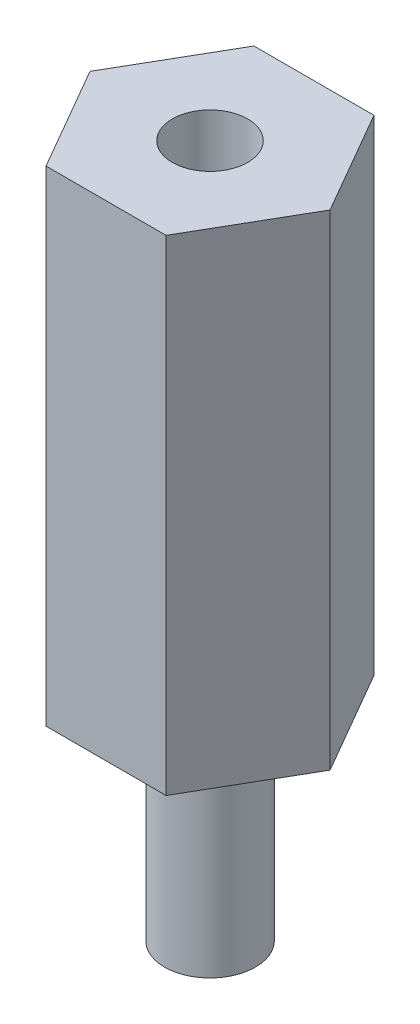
ISO-10303-21;
HEADER;
FILE_DESCRIPTION(('STEP AP214'),'2;1');
FILE_NAME('part.step','',(''),(''),'','','');
FILE_SCHEMA(('AUTOMOTIVE_DESIGN { 1 0 10303 214 1 1 1 1 }'));
ENDSEC;
DATA;
#1=APPLICATION_CONTEXT('core data for automotive mechanical design processes');
#2=APPLICATION_PROTOCOL_DEFINITION('international standard','automotive_design',2000,#1);
#3=PRODUCT_CONTEXT('',#1,'mechanical');
#4=PRODUCT('Part','Part','',(#3));
#5=PRODUCT_RELATED_PRODUCT_CATEGORY('part','',(#4));
#6=PRODUCT_DEFINITION_FORMATION('','',#4);
#7=PRODUCT_DEFINITION_CONTEXT('part definition',#1,'design');
#8=PRODUCT_DEFINITION('design','',#6,#7);
#9=PRODUCT_DEFINITION_SHAPE('','',#8);
#10=(LENGTH_UNIT() NAMED_UNIT(*) SI_UNIT(.MILLI.,.METRE.));
#11=(NAMED_UNIT(*) PLANE_ANGLE_UNIT() SI_UNIT($,.RADIAN.));
#12=(NAMED_UNIT(*) SI_UNIT($,.STERADIAN.) SOLID_ANGLE_UNIT());
#13=UNCERTAINTY_MEASURE_WITH_UNIT(LENGTH_MEASURE(1.E-05),#10,'distance_accuracy_value','');
#14=(GEOMETRIC_REPRESENTATION_CONTEXT(3) GLOBAL_UNCERTAINTY_ASSIGNED_CONTEXT((#13)) GLOBAL_UNIT_ASSIGNED_CONTEXT((#10,
#11,#12)) REPRESENTATION_CONTEXT('',''));
#15=CARTESIAN_POINT('',(0.,0.,0.));
#16=DIRECTION('',(0.,0.,1.));
#17=DIRECTION('',(1.,0.,0.));
#18=AXIS2_PLACEMENT_3D('',#15,#16,#17);
#19=CARTESIAN_POINT('',(8.24889197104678,0.,-4.7625));
#20=DIRECTION('',(0.,1.,0.));
#21=DIRECTION('',(0.,0.,1.));
#22=AXIS2_PLACEMENT_3D('',#19,#20,#21);
#23=PLANE('',#22);
#24=DIRECTION('',(0.5,0.,-0.866025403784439));
#25=VECTOR('',#24,1.);
#26=CARTESIAN_POINT('',(2.74963065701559,0.,4.7625));
#27=LINE('',#26,#25);
#28=CARTESIAN_POINT('',(2.74963065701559,0.,4.7625));
#29=VERTEX_POINT('',#28);
#30=CARTESIAN_POINT('',(5.49926131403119,0.,0.));
#31=VERTEX_POINT('',#30);
#32=EDGE_CURVE('E109',#29,#31,#27,.T.);
#33=ORIENTED_EDGE('',*,*,#32,.F.);
#34=DIRECTION('',(1.,0.,0.));
#35=VECTOR('',#34,1.);
#36=CARTESIAN_POINT('',(-2.74963065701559,0.,4.7625));
#37=LINE('',#36,#35);
#38=CARTESIAN_POINT('',(-2.74963065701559,0.,4.7625));
#39=VERTEX_POINT('',#38);
#40=EDGE_CURVE('E120',#39,#29,#37,.T.);
#41=ORIENTED_EDGE('',*,*,#40,.F.);
#42=DIRECTION('',(0.5,0.,0.866025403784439));
#43=VECTOR('',#42,1.);
#44=CARTESIAN_POINT('',(-5.49926131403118,0.,0.));
#45=LINE('',#44,#43);
#46=CARTESIAN_POINT('',(-5.49926131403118,0.,0.));
#47=VERTEX_POINT('',#46);
#48=EDGE_CURVE('E118',#47,#39,#45,.T.);
#49=ORIENTED_EDGE('',*,*,#48,.F.);
#50=DIRECTION('',(-0.5,0.,0.866025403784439));
#51=VECTOR('',#50,1.);
#52=CARTESIAN_POINT('',(-2.74963065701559,0.,-4.7625));
#53=LINE('',#52,#51);
#54=CARTESIAN_POINT('',(-2.74963065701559,0.,-4.7625));
#55=VERTEX_POINT('',#54);
#56=EDGE_CURVE('E116',#55,#47,#53,.T.);
#57=ORIENTED_EDGE('',*,*,#56,.F.);
#58=DIRECTION('',(-1.,0.,0.));
#59=VECTOR('',#58,1.);
#60=CARTESIAN_POINT('',(2.74963065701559,0.,-4.7625));
#61=LINE('',#60,#59);
#62=CARTESIAN_POINT('',(2.74963065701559,0.,-4.7625));
#63=VERTEX_POINT('',#62);
#64=EDGE_CURVE('E114',#63,#55,#61,.T.);
#65=ORIENTED_EDGE('',*,*,#64,.F.);
#66=DIRECTION('',(-0.5,0.,-0.866025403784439));
#67=VECTOR('',#66,1.);
#68=CARTESIAN_POINT('',(5.49926131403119,0.,0.));
#69=LINE('',#68,#67);
#70=EDGE_CURVE('E112',#31,#63,#69,.T.);
#71=ORIENTED_EDGE('',*,*,#70,.F.);
#72=EDGE_LOOP('',(#33,#41,#49,#57,#65,#71));
#73=FACE_BOUND('',#72,.T.);
#74=CARTESIAN_POINT('',(0.,0.,0.));
#75=DIRECTION('',(0.,1.,0.));
#76=DIRECTION('',(0.,0.,1.));
#77=AXIS2_PLACEMENT_3D('',#74,#75,#76);
#78=CIRCLE('',#77,2.0828);
#79=CARTESIAN_POINT('',(0.,0.,2.0828));
#80=VERTEX_POINT('',#79);
#81=EDGE_CURVE('E11',#80,#80,#78,.F.);
#82=ORIENTED_EDGE('',*,*,#81,.F.);
#83=EDGE_LOOP('',(#82));
#84=FACE_BOUND('',#83,.T.);
#85=ADVANCED_FACE('F38',(#73,#84),#23,.F.);
#86=CARTESIAN_POINT('',(2.74963065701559,22.225,4.7625));
#87=DIRECTION('',(-0.866025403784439,0.,-0.5));
#88=DIRECTION('',(-0.5,0.,0.866025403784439));
#89=AXIS2_PLACEMENT_3D('',#86,#87,#88);
#90=PLANE('',#89);
#91=ORIENTED_EDGE('',*,*,#32,.T.);
#92=DIRECTION('',(0.,-1.,0.));
#93=VECTOR('',#92,1.);
#94=CARTESIAN_POINT('',(5.49926131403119,22.225,0.));
#95=LINE('',#94,#93);
#96=CARTESIAN_POINT('',(5.49926131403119,22.225,0.));
#97=VERTEX_POINT('',#96);
#98=EDGE_CURVE('E46',#97,#31,#95,.T.);
#99=ORIENTED_EDGE('',*,*,#98,.F.);
#100=DIRECTION('',(0.5,0.,-0.866025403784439));
#101=VECTOR('',#100,1.);
#102=CARTESIAN_POINT('',(2.74963065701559,22.225,4.7625));
#103=LINE('',#102,#101);
#104=CARTESIAN_POINT('',(2.74963065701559,22.225,4.7625));
#105=VERTEX_POINT('',#104);
#106=EDGE_CURVE('E122',#105,#97,#103,.T.);
#107=ORIENTED_EDGE('',*,*,#106,.F.);
#108=DIRECTION('',(0.,-1.,0.));
#109=VECTOR('',#108,1.);
#110=CARTESIAN_POINT('',(2.74963065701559,22.225,4.7625));
#111=LINE('',#110,#109);
#112=EDGE_CURVE('E132',#105,#29,#111,.T.);
#113=ORIENTED_EDGE('',*,*,#112,.T.);
#114=EDGE_LOOP('',(#91,#99,#107,#113));
#115=FACE_BOUND('',#114,.T.);
#116=ADVANCED_FACE('F40',(#115),#90,.F.);
#117=CARTESIAN_POINT('',(5.49926131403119,22.225,0.));
#118=DIRECTION('',(-0.866025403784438,0.,0.5));
#119=DIRECTION('',(0.5,0.,0.866025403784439));
#120=AXIS2_PLACEMENT_3D('',#117,#118,#119);
#121=PLANE('',#120);
#122=ORIENTED_EDGE('',*,*,#70,.T.);
#123=DIRECTION('',(0.,-1.,0.));
#124=VECTOR('',#123,1.);
#125=CARTESIAN_POINT('',(2.74963065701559,22.225,-4.7625));
#126=LINE('',#125,#124);
#127=CARTESIAN_POINT('',(2.74963065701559,22.225,-4.7625));
#128=VERTEX_POINT('',#127);
#129=EDGE_CURVE('E144',#128,#63,#126,.T.);
#130=ORIENTED_EDGE('',*,*,#129,.F.);
#131=DIRECTION('',(-0.5,0.,-0.866025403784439));
#132=VECTOR('',#131,1.);
#133=CARTESIAN_POINT('',(5.49926131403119,22.225,0.));
#134=LINE('',#133,#132);
#135=EDGE_CURVE('E124',#97,#128,#134,.T.);
#136=ORIENTED_EDGE('',*,*,#135,.F.);
#137=ORIENTED_EDGE('',*,*,#98,.T.);
#138=EDGE_LOOP('',(#122,#130,#136,#137));
#139=FACE_BOUND('',#138,.T.);
#140=ADVANCED_FACE('F149',(#139),#121,.F.);
#141=CARTESIAN_POINT('',(2.74963065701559,22.225,-4.7625));
#142=DIRECTION('',(0.,0.,1.));
#143=DIRECTION('',(1.,0.,0.));
#144=AXIS2_PLACEMENT_3D('',#141,#142,#143);
#145=PLANE('',#144);
#146=ORIENTED_EDGE('',*,*,#64,.T.);
#147=DIRECTION('',(0.,-1.,0.));
#148=VECTOR('',#147,1.);
#149=CARTESIAN_POINT('',(-2.74963065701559,22.225,-4.7625));
#150=LINE('',#149,#148);
#151=CARTESIAN_POINT('',(-2.74963065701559,22.225,-4.7625));
#152=VERTEX_POINT('',#151);
#153=EDGE_CURVE('E141',#152,#55,#150,.T.);
#154=ORIENTED_EDGE('',*,*,#153,.F.);
#155=DIRECTION('',(-1.,0.,0.));
#156=VECTOR('',#155,1.);
#157=CARTESIAN_POINT('',(2.74963065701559,22.225,-4.7625));
#158=LINE('',#157,#156);
#159=EDGE_CURVE('E126',#128,#152,#158,.T.);
#160=ORIENTED_EDGE('',*,*,#159,.F.);
#161=ORIENTED_EDGE('',*,*,#129,.T.);
#162=EDGE_LOOP('',(#146,#154,#160,#161));
#163=FACE_BOUND('',#162,.T.);
#164=ADVANCED_FACE('F162',(#163),#145,.F.);
#165=CARTESIAN_POINT('',(-2.74963065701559,22.225,-4.7625));
#166=DIRECTION('',(0.866025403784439,0.,0.5));
#167=DIRECTION('',(0.5,0.,-0.866025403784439));
#168=AXIS2_PLACEMENT_3D('',#165,#166,#167);
#169=PLANE('',#168);
#170=ORIENTED_EDGE('',*,*,#56,.T.);
#171=DIRECTION('',(0.,-1.,0.));
#172=VECTOR('',#171,1.);
#173=CARTESIAN_POINT('',(-5.49926131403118,22.225,0.));
#174=LINE('',#173,#172);
#175=CARTESIAN_POINT('',(-5.49926131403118,22.225,0.));
#176=VERTEX_POINT('',#175);
#177=EDGE_CURVE('E138',#176,#47,#174,.T.);
#178=ORIENTED_EDGE('',*,*,#177,.F.);
#179=DIRECTION('',(-0.5,0.,0.866025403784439));
#180=VECTOR('',#179,1.);
#181=CARTESIAN_POINT('',(-2.74963065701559,22.225,-4.7625));
#182=LINE('',#181,#180);
#183=EDGE_CURVE('E128',#152,#176,#182,.T.);
#184=ORIENTED_EDGE('',*,*,#183,.F.);
#185=ORIENTED_EDGE('',*,*,#153,.T.);
#186=EDGE_LOOP('',(#170,#178,#184,#185));
#187=FACE_BOUND('',#186,.T.);
#188=ADVANCED_FACE('F166',(#187),#169,.F.);
#189=CARTESIAN_POINT('',(-5.49926131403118,22.225,0.));
#190=DIRECTION('',(0.866025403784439,0.,-0.5));
#191=DIRECTION('',(-0.5,0.,-0.866025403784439));
#192=AXIS2_PLACEMENT_3D('',#189,#190,#191);
#193=PLANE('',#192);
#194=ORIENTED_EDGE('',*,*,#48,.T.);
#195=DIRECTION('',(0.,-1.,0.));
#196=VECTOR('',#195,1.);
#197=CARTESIAN_POINT('',(-2.74963065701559,22.225,4.7625));
#198=LINE('',#197,#196);
#199=CARTESIAN_POINT('',(-2.74963065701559,22.225,4.7625));
#200=VERTEX_POINT('',#199);
#201=EDGE_CURVE('E135',#200,#39,#198,.T.);
#202=ORIENTED_EDGE('',*,*,#201,.F.);
#203=DIRECTION('',(0.5,0.,0.866025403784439));
#204=VECTOR('',#203,1.);
#205=CARTESIAN_POINT('',(-5.49926131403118,22.225,0.));
#206=LINE('',#205,#204);
#207=EDGE_CURVE('E58',#176,#200,#206,.T.);
#208=ORIENTED_EDGE('',*,*,#207,.F.);
#209=ORIENTED_EDGE('',*,*,#177,.T.);
#210=EDGE_LOOP('',(#194,#202,#208,#209));
#211=FACE_BOUND('',#210,.T.);
#212=ADVANCED_FACE('F181',(#211),#193,.F.);
#213=CARTESIAN_POINT('',(-2.74963065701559,22.225,4.7625));
#214=DIRECTION('',(0.,0.,-1.));
#215=DIRECTION('',(-1.,0.,0.));
#216=AXIS2_PLACEMENT_3D('',#213,#214,#215);
#217=PLANE('',#216);
#218=ORIENTED_EDGE('',*,*,#40,.T.);
#219=ORIENTED_EDGE('',*,*,#112,.F.);
#220=DIRECTION('',(1.,0.,0.));
#221=VECTOR('',#220,1.);
#222=CARTESIAN_POINT('',(-2.74963065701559,22.225,4.7625));
#223=LINE('',#222,#221);
#224=EDGE_CURVE('E53',#200,#105,#223,.T.);
#225=ORIENTED_EDGE('',*,*,#224,.F.);
#226=ORIENTED_EDGE('',*,*,#201,.T.);
#227=EDGE_LOOP('',(#218,#219,#225,#226));
#228=FACE_BOUND('',#227,.T.);
#229=ADVANCED_FACE('F171',(#228),#217,.F.);
#230=CARTESIAN_POINT('',(8.24889197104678,22.225,-4.7625));
#231=DIRECTION('',(0.,1.,0.));
#232=DIRECTION('',(0.,0.,1.));
#233=AXIS2_PLACEMENT_3D('',#230,#231,#232);
#234=PLANE('',#233);
#235=CARTESIAN_POINT('',(0.,22.225,0.));
#236=DIRECTION('',(0.,1.,0.));
#237=DIRECTION('',(0.,0.,1.));
#238=AXIS2_PLACEMENT_3D('',#235,#236,#237);
#239=CIRCLE('',#238,1.7272);
#240=CARTESIAN_POINT('',(0.,22.225,1.7272));
#241=VERTEX_POINT('',#240);
#242=EDGE_CURVE('E101',#241,#241,#239,.T.);
#243=ORIENTED_EDGE('',*,*,#242,.F.);
#244=EDGE_LOOP('',(#243));
#245=FACE_BOUND('',#244,.T.);
#246=ORIENTED_EDGE('',*,*,#106,.T.);
#247=ORIENTED_EDGE('',*,*,#135,.T.);
#248=ORIENTED_EDGE('',*,*,#159,.T.);
#249=ORIENTED_EDGE('',*,*,#183,.T.);
#250=ORIENTED_EDGE('',*,*,#207,.T.);
#251=ORIENTED_EDGE('',*,*,#224,.T.);
#252=EDGE_LOOP('',(#246,#247,#248,#249,#250,#251));
#253=FACE_BOUND('',#252,.T.);
#254=ADVANCED_FACE('F168',(#245,#253),#234,.T.);
#255=CARTESIAN_POINT('',(0.,-9.525,0.));
#256=DIRECTION('',(0.,1.,0.));
#257=DIRECTION('',(0.,0.,1.));
#258=AXIS2_PLACEMENT_3D('',#255,#256,#257);
#259=CYLINDRICAL_SURFACE('',#258,2.0828);
#260=CARTESIAN_POINT('',(0.,-9.525,0.));
#261=DIRECTION('',(0.,-1.,0.));
#262=DIRECTION('',(0.,0.,-1.));
#263=AXIS2_PLACEMENT_3D('',#260,#261,#262);
#264=CIRCLE('',#263,2.0828);
#265=CARTESIAN_POINT('',(0.,-9.525,2.0828));
#266=VERTEX_POINT('',#265);
#267=EDGE_CURVE('E104',#266,#266,#264,.T.);
#268=CARTESIAN_POINT('',(0.,-9.525,2.0828));
#269=CARTESIAN_POINT('',(0.,-9.42578125,2.0828));
#270=CARTESIAN_POINT('',(0.,-9.3265625,2.0828));
#271=CARTESIAN_POINT('',(0.,-9.128125,2.0828));
#272=CARTESIAN_POINT('',(0.,-9.02890625,2.0828));
#273=CARTESIAN_POINT('',(0.,-8.83046875,2.0828));
#274=CARTESIAN_POINT('',(0.,-8.73125,2.0828));
#275=CARTESIAN_POINT('',(0.,-8.5328125,2.0828));
#276=CARTESIAN_POINT('',(0.,-8.43359375,2.0828));
#277=CARTESIAN_POINT('',(0.,-8.23515625,2.0828));
#278=CARTESIAN_POINT('',(0.,-8.1359375,2.0828));
#279=CARTESIAN_POINT('',(0.,-7.9375,2.0828));
#280=CARTESIAN_POINT('',(0.,-7.83828125,2.0828));
#281=CARTESIAN_POINT('',(0.,-7.63984375,2.0828));
#282=CARTESIAN_POINT('',(0.,-7.540625,2.0828));
#283=CARTESIAN_POINT('',(0.,-7.3421875,2.0828));
#284=CARTESIAN_POINT('',(0.,-7.24296875,2.0828));
#285=CARTESIAN_POINT('',(0.,-7.04453125,2.0828));
#286=CARTESIAN_POINT('',(0.,-6.9453125,2.0828));
#287=CARTESIAN_POINT('',(0.,-6.746875,2.0828));
#288=CARTESIAN_POINT('',(0.,-6.64765625,2.0828));
#289=CARTESIAN_POINT('',(0.,-6.44921875,2.0828));
#290=CARTESIAN_POINT('',(0.,-6.35,2.0828));
#291=CARTESIAN_POINT('',(0.,-6.1515625,2.0828));
#292=CARTESIAN_POINT('',(0.,-6.05234375,2.0828));
#293=CARTESIAN_POINT('',(0.,-5.85390625,2.0828));
#294=CARTESIAN_POINT('',(0.,-5.7546875,2.0828));
#295=CARTESIAN_POINT('',(0.,-5.55625,2.0828));
#296=CARTESIAN_POINT('',(0.,-5.45703125,2.0828));
#297=CARTESIAN_POINT('',(0.,-5.25859375,2.0828));
#298=CARTESIAN_POINT('',(0.,-5.159375,2.0828));
#299=CARTESIAN_POINT('',(0.,-4.9609375,2.0828));
#300=CARTESIAN_POINT('',(0.,-4.86171875,2.0828));
#301=CARTESIAN_POINT('',(0.,-4.66328125,2.0828));
#302=CARTESIAN_POINT('',(0.,-4.5640625,2.0828));
#303=CARTESIAN_POINT('',(0.,-4.365625,2.0828));
#304=CARTESIAN_POINT('',(0.,-4.26640625,2.0828));
#305=CARTESIAN_POINT('',(0.,-4.06796875,2.0828));
#306=CARTESIAN_POINT('',(0.,-3.96875,2.0828));
#307=CARTESIAN_POINT('',(0.,-3.7703125,2.0828));
#308=CARTESIAN_POINT('',(0.,-3.67109375,2.0828));
#309=CARTESIAN_POINT('',(0.,-3.47265625,2.0828));
#310=CARTESIAN_POINT('',(0.,-3.3734375,2.0828));
#311=CARTESIAN_POINT('',(0.,-3.175,2.0828));
#312=CARTESIAN_POINT('',(0.,-3.07578125,2.0828));
#313=CARTESIAN_POINT('',(0.,-2.87734375,2.0828));
#314=CARTESIAN_POINT('',(0.,-2.778125,2.0828));
#315=CARTESIAN_POINT('',(0.,-2.5796875,2.0828));
#316=CARTESIAN_POINT('',(0.,-2.48046875,2.0828));
#317=CARTESIAN_POINT('',(0.,-2.28203125,2.0828));
#318=CARTESIAN_POINT('',(0.,-2.1828125,2.0828));
#319=CARTESIAN_POINT('',(0.,-1.984375,2.0828));
#320=CARTESIAN_POINT('',(0.,-1.88515625,2.0828));
#321=CARTESIAN_POINT('',(0.,-1.68671875,2.0828));
#322=CARTESIAN_POINT('',(0.,-1.5875,2.0828));
#323=CARTESIAN_POINT('',(0.,-1.3890625,2.0828));
#324=CARTESIAN_POINT('',(0.,-1.28984375,2.0828));
#325=CARTESIAN_POINT('',(0.,-1.09140625,2.0828));
#326=CARTESIAN_POINT('',(0.,-0.992187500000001,2.0828));
#327=CARTESIAN_POINT('',(0.,-0.793750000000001,2.0828));
#328=CARTESIAN_POINT('',(0.,-0.69453125,2.0828));
#329=CARTESIAN_POINT('',(0.,-0.49609375,2.0828));
#330=CARTESIAN_POINT('',(0.,-0.396875,2.0828));
#331=CARTESIAN_POINT('',(0.,-0.1984375,2.0828));
#332=CARTESIAN_POINT('',(0.,-0.0992187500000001,2.0828));
#333=CARTESIAN_POINT('',(0.,0.,2.0828));
#334=B_SPLINE_CURVE_WITH_KNOTS('',3,(#268,#269,#270,#271,#272,#273,#274,#275,#276,#277,#278,
#279,#280,#281,#282,#283,#284,#285,#286,#287,#288,#289,#290,#291,#292,#293,#294,#295,#296,#297,
#298,#299,#300,#301,#302,#303,#304,#305,#306,#307,#308,#309,#310,#311,#312,#313,#314,#315,#316,
#317,#318,#319,#320,#321,#322,#323,#324,#325,#326,#327,#328,#329,#330,#331,#332,#333),
.UNSPECIFIED.,.F.,.F.,(4,2,2,2,2,2,2,2,2,2,2,2,2,2,2,2,2,2,2,2,2,2,2,2,2,2,2,2,2,2,2,2,4),(0.,
0.297656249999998,0.595312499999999,0.892968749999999,1.190625,1.48828125,1.7859375,2.08359375,
2.38125,2.67890625,2.9765625,3.27421875,3.571875,3.86953125,4.1671875,4.46484375,4.7625,
5.06015625,5.3578125,5.65546875,5.953125,6.25078125,6.5484375,6.84609375,7.14375,7.44140625,
7.7390625,8.03671875,8.334375,8.63203125,8.9296875,9.22734375,9.525),.UNSPECIFIED.);
#335=EDGE_CURVE('BSEAM170',#266,#80,#334,.T.);
#336=ORIENTED_EDGE('',*,*,#267,.F.);
#337=ORIENTED_EDGE('',*,*,#81,.T.);
#338=ORIENTED_EDGE('',*,*,#335,.T.);
#339=ORIENTED_EDGE('',*,*,#335,.F.);
#340=EDGE_LOOP('',(#336,#338,#337,#339));
#341=FACE_BOUND('',#340,.T.);
#342=ADVANCED_FACE('F170',(#341),#259,.T.);
#343=CARTESIAN_POINT('',(0.,-9.525,0.));
#344=DIRECTION('',(0.,-1.,0.));
#345=DIRECTION('',(0.,0.,-1.));
#346=AXIS2_PLACEMENT_3D('',#343,#344,#345);
#347=PLANE('',#346);
#348=ORIENTED_EDGE('',*,*,#267,.T.);
#349=EDGE_LOOP('',(#348));
#350=FACE_BOUND('',#349,.T.);
#351=ADVANCED_FACE('F178',(#350),#347,.T.);
#352=CARTESIAN_POINT('',(0.,22.225,0.));
#353=DIRECTION('',(0.,1.,0.));
#354=DIRECTION('',(0.,0.,1.));
#355=AXIS2_PLACEMENT_3D('',#352,#353,#354);
#356=CYLINDRICAL_SURFACE('',#355,1.7272);
#357=CARTESIAN_POINT('',(0.,8.3566,0.));
#358=DIRECTION('',(0.,1.,0.));
#359=DIRECTION('',(0.,0.,1.));
#360=AXIS2_PLACEMENT_3D('',#357,#358,#359);
#361=CIRCLE('',#360,1.7272);
#362=CARTESIAN_POINT('',(0.,8.3566,1.7272));
#363=VERTEX_POINT('',#362);
#364=EDGE_CURVE('E99',#363,#363,#361,.T.);
#365=ORIENTED_EDGE('',*,*,#364,.F.);
#366=EDGE_LOOP('',(#365));
#367=FACE_BOUND('',#366,.T.);
#368=ORIENTED_EDGE('',*,*,#242,.T.);
#369=EDGE_LOOP('',(#368));
#370=FACE_BOUND('',#369,.T.);
#371=ADVANCED_FACE('F95',(#367,#370),#356,.F.);
#372=CARTESIAN_POINT('',(0.,8.3566,0.));
#373=DIRECTION('',(0.,1.,0.));
#374=DIRECTION('',(0.,0.,1.));
#375=AXIS2_PLACEMENT_3D('',#372,#373,#374);
#376=CONICAL_SURFACE('',#375,1.7272,1.02974425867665);
#377=CARTESIAN_POINT('',(0.,7.31879353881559,0.));
#378=VERTEX_POINT('',#377);
#379=VERTEX_LOOP('',#378);
#380=FACE_BOUND('',#379,.T.);
#381=ORIENTED_EDGE('',*,*,#364,.T.);
#382=EDGE_LOOP('',(#381));
#383=FACE_BOUND('',#382,.T.);
#384=ADVANCED_FACE('F92',(#380,#383),#376,.F.);
#385=CLOSED_SHELL('',(#85,#116,#140,#164,#188,#212,#229,#254,#342,#351,#371,#384));
#386=MANIFOLD_SOLID_BREP('B2',#385);
#387=ADVANCED_BREP_SHAPE_REPRESENTATION('',(#18,#386),#14);
#388=SHAPE_DEFINITION_REPRESENTATION(#9,#387);
ENDSEC;
END-ISO-10303-21;
